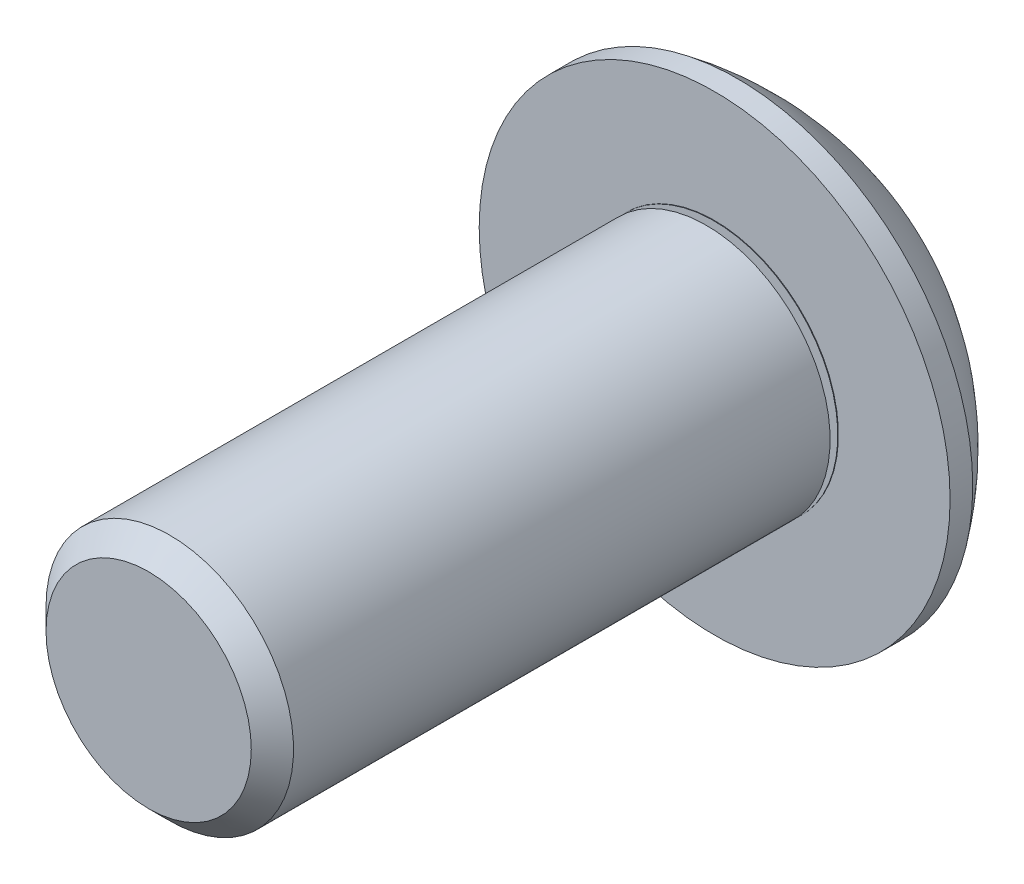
from build123d import *

# Parameters (mm, degrees)
CUT_EXTRUDE1_DEPTH = 1.3208


with BuildPart() as part:
    # Logo3_bib1 → Revolve1 (revolve)
    with BuildSketch(Plane(origin=(0, 0, 0), x_dir=(-1, 0, 0), z_dir=(0, -1, 0))):
        with BuildLine():
            Line((0, -9.525), (0, 2.2098))
            Line((0, 2.2098), (1.49225, 2.2098))
            ThreePointArc((1.49225, 2.2098), (2.868948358, 1.486689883), (3.9624, 0.381))
            Line((3.9624, 0.381), (3.9624, 0))
            Line((3.9624, 0), (2.0828, 0))
            Line((2.0828, 0), (2.0828, -0.01))
            Line((2.0828, -0.01), (1.840625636, -0.01))
            ThreePointArc((1.840625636, -0.01), (1.820929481, -0.026527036), (1.833785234, -0.048793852))
            Line((1.833785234, -0.048793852), (2.0828, -0.139427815))
            Line((2.0828, -0.139427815), (2.0828, -9.1694))
            Line((2.0828, -9.1694), (1.7272, -9.525))
            Line((1.7272, -9.525), (0, -9.525))
        make_face()
    revolve(axis=Axis((0, 0, -10.585154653), (0, 0, 1)))

    # Logo3_bib2 → Cut-Extrude1 (cut)
    with BuildSketch(Plane(origin=(0, 0, -2.2098), x_dir=(1, 0, 0), z_dir=(0, 0, -1))):
        Polygon((1.375548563, 0), (0.687774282, 1.19126), (-0.687774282, 1.19126), (-1.375548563, 0), (-0.687774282, -1.19126), (0.687774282, -1.19126), align=None)
    extrude(amount=-CUT_EXTRUDE1_DEPTH, mode=Mode.SUBTRACT)


solid = part.part
